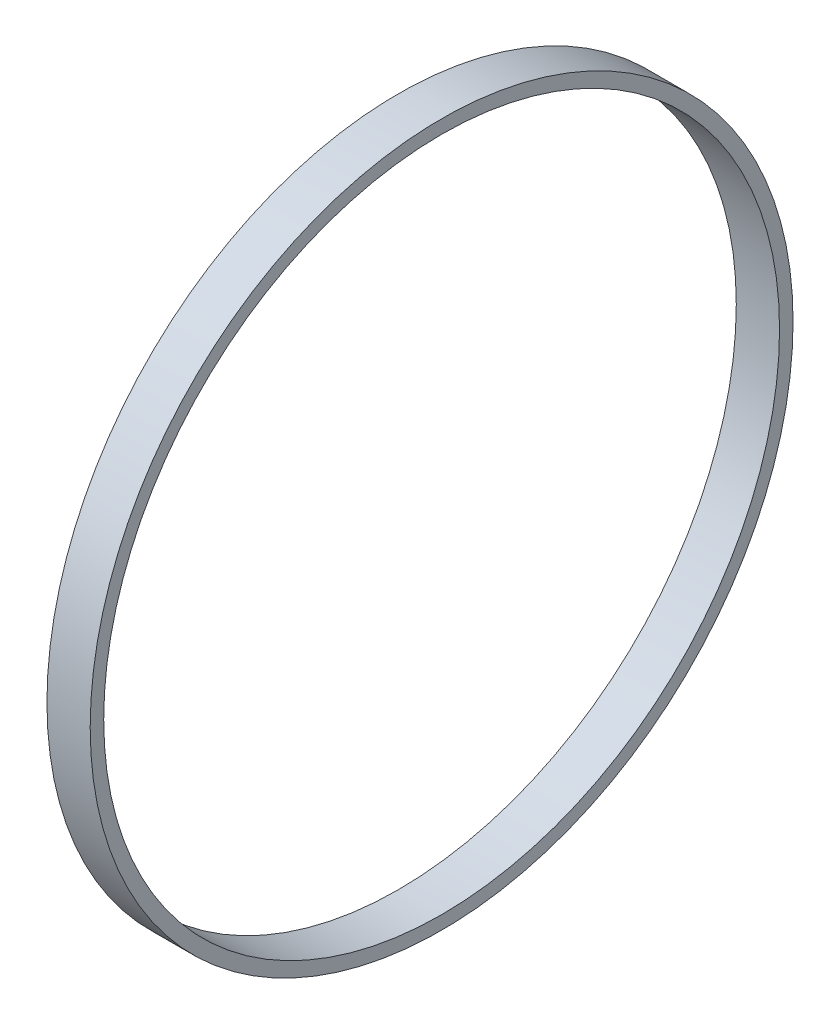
from build123d import *

# Parameters (mm, degrees)
SKETCH1_R              = 82.55
SKETCH1_R_2            = 79.375
CIRCULAR_SECTION_DEPTH = 10.16


with BuildPart() as part:
    # Sketch1 → Circular_section (new body)
    with BuildSketch(Plane.YZ):
        with Locations(Location((0, 0, 0), (0, 0, 270))):
            Circle(SKETCH1_R)
        with Locations(Location((0, 0, 0), (0, 0, 270))):
            Circle(SKETCH1_R_2, mode=Mode.SUBTRACT)
    extrude(amount=CIRCULAR_SECTION_DEPTH)


solid = part.part
